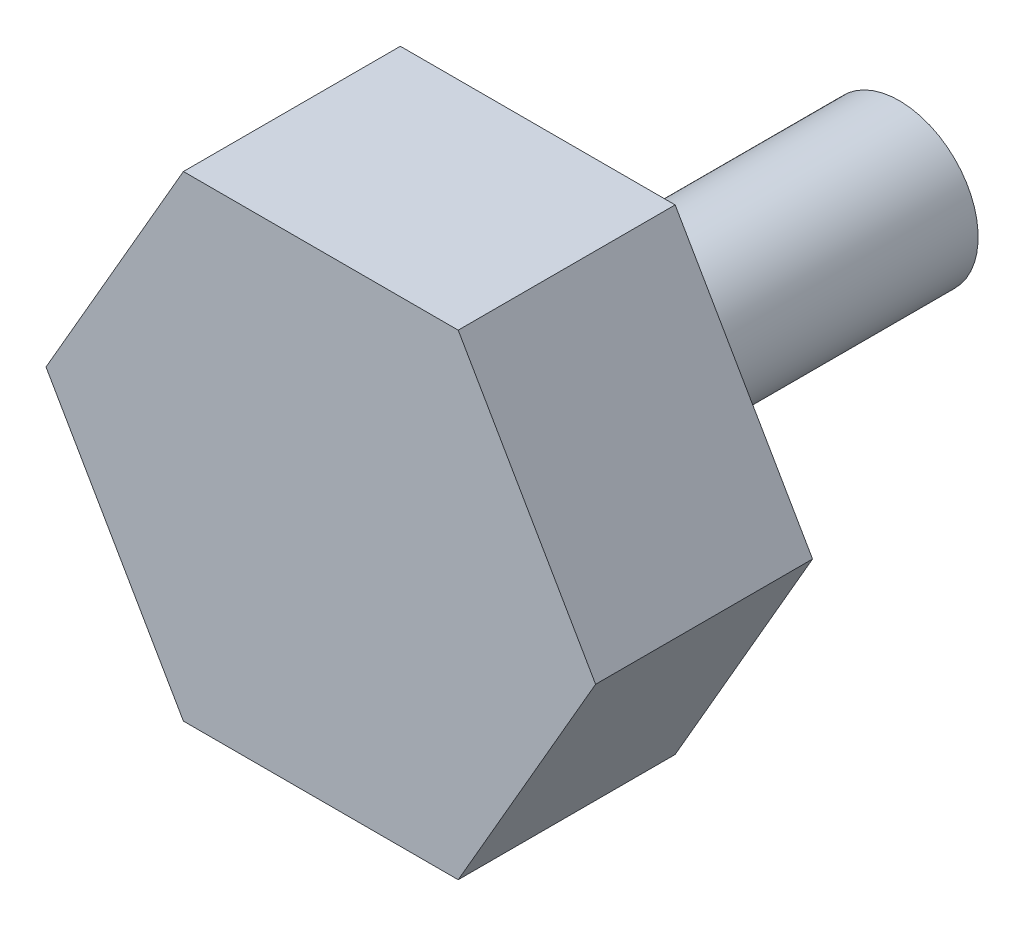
from build123d import *

# Parameters (mm, degrees)
BOSS_EXTRUDE1_DEPTH = 3
SKETCH2_R           = 1.09
BOSS_EXTRUDE2_DEPTH = 5


with BuildPart() as part:
    # Sketch1 → Boss-Extrude1 (new body)
    with BuildSketch(Plane.XY):
        Polygon((1.9, -3.290896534), (3.8, 0), (1.9, 3.290896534), (-1.9, 3.290896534), (-3.8, 0), (-1.9, -3.290896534), align=None)
    extrude(amount=BOSS_EXTRUDE1_DEPTH)

    # Sketch2 → Boss-Extrude2 (add)
    with BuildSketch(Plane(origin=(0, 0, 0), x_dir=(-1, 0, 0), z_dir=(0, 0, -1))):
        Circle(SKETCH2_R)
    extrude(amount=BOSS_EXTRUDE2_DEPTH)


solid = part.part
